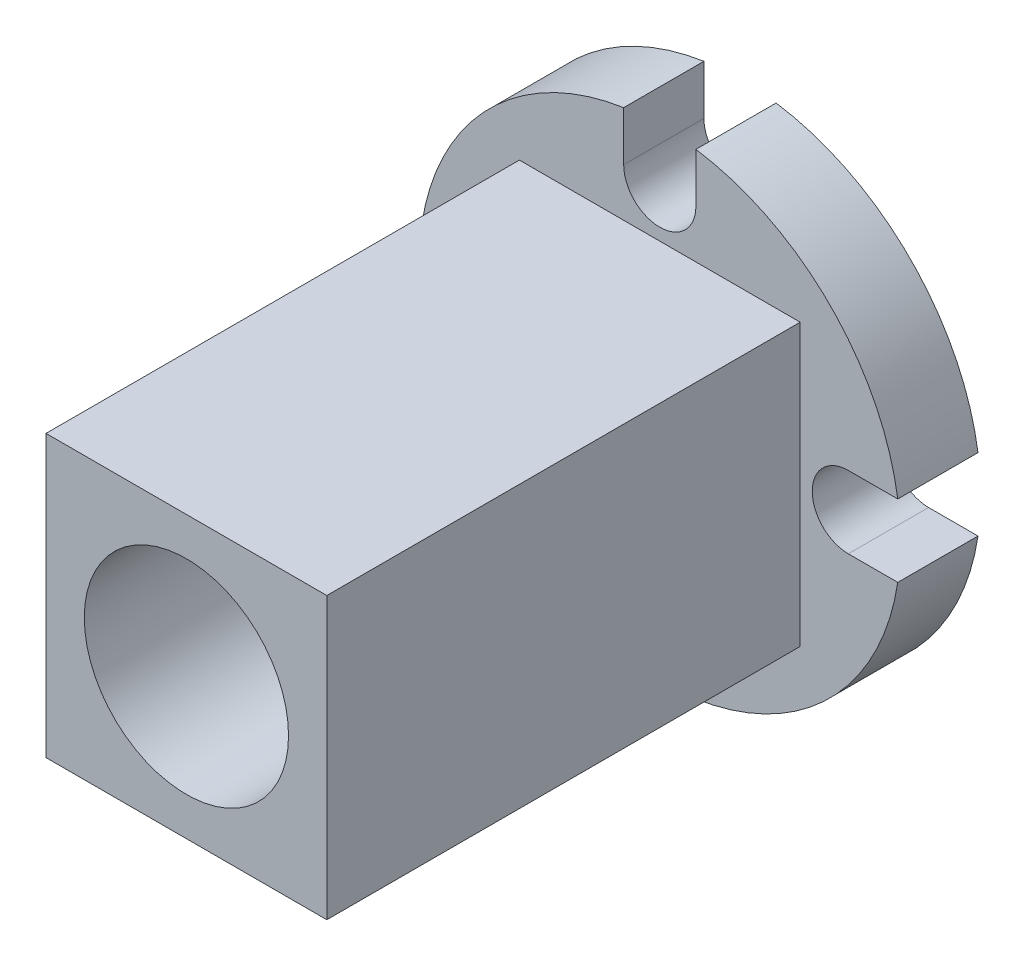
ISO-10303-21;
HEADER;
FILE_DESCRIPTION(('STEP AP214'),'2;1');
FILE_NAME('part.step','',(''),(''),'','','');
FILE_SCHEMA(('AUTOMOTIVE_DESIGN { 1 0 10303 214 1 1 1 1 }'));
ENDSEC;
DATA;
#1=APPLICATION_CONTEXT('core data for automotive mechanical design processes');
#2=APPLICATION_PROTOCOL_DEFINITION('international standard','automotive_design',2000,#1);
#3=PRODUCT_CONTEXT('',#1,'mechanical');
#4=PRODUCT('Part','Part','',(#3));
#5=PRODUCT_RELATED_PRODUCT_CATEGORY('part','',(#4));
#6=PRODUCT_DEFINITION_FORMATION('','',#4);
#7=PRODUCT_DEFINITION_CONTEXT('part definition',#1,'design');
#8=PRODUCT_DEFINITION('design','',#6,#7);
#9=PRODUCT_DEFINITION_SHAPE('','',#8);
#10=(LENGTH_UNIT() NAMED_UNIT(*) SI_UNIT(.MILLI.,.METRE.));
#11=(NAMED_UNIT(*) PLANE_ANGLE_UNIT() SI_UNIT($,.RADIAN.));
#12=(NAMED_UNIT(*) SI_UNIT($,.STERADIAN.) SOLID_ANGLE_UNIT());
#13=UNCERTAINTY_MEASURE_WITH_UNIT(LENGTH_MEASURE(1.E-05),#10,'distance_accuracy_value','');
#14=(GEOMETRIC_REPRESENTATION_CONTEXT(3) GLOBAL_UNCERTAINTY_ASSIGNED_CONTEXT((#13)) GLOBAL_UNIT_ASSIGNED_CONTEXT((#10,
#11,#12)) REPRESENTATION_CONTEXT('',''));
#15=CARTESIAN_POINT('',(0.,0.,0.));
#16=DIRECTION('',(0.,0.,1.));
#17=DIRECTION('',(1.,0.,0.));
#18=AXIS2_PLACEMENT_3D('',#15,#16,#17);
#19=CARTESIAN_POINT('',(-17.5,-17.5,69.));
#20=DIRECTION('',(0.,0.,1.));
#21=DIRECTION('',(1.,0.,0.));
#22=AXIS2_PLACEMENT_3D('',#19,#20,#21);
#23=PLANE('',#22);
#24=CARTESIAN_POINT('',(0.,0.,69.));
#25=DIRECTION('',(0.,0.,1.));
#26=DIRECTION('',(1.,0.,0.));
#27=AXIS2_PLACEMENT_3D('',#24,#25,#26);
#28=CIRCLE('',#27,12.7279220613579);
#29=CARTESIAN_POINT('',(12.7279220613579,0.,69.));
#30=VERTEX_POINT('',#29);
#31=EDGE_CURVE('E411',#30,#30,#28,.T.);
#32=ORIENTED_EDGE('',*,*,#31,.F.);
#33=EDGE_LOOP('',(#32));
#34=FACE_BOUND('',#33,.T.);
#35=DIRECTION('',(0.,-1.,0.));
#36=VECTOR('',#35,1.);
#37=CARTESIAN_POINT('',(-17.5,17.5,69.));
#38=LINE('',#37,#36);
#39=CARTESIAN_POINT('',(-17.5,17.5,69.));
#40=VERTEX_POINT('',#39);
#41=CARTESIAN_POINT('',(-17.5,-17.5,69.));
#42=VERTEX_POINT('',#41);
#43=EDGE_CURVE('E402',#40,#42,#38,.T.);
#44=ORIENTED_EDGE('',*,*,#43,.T.);
#45=DIRECTION('',(1.,0.,0.));
#46=VECTOR('',#45,1.);
#47=CARTESIAN_POINT('',(-17.5,-17.5,69.));
#48=LINE('',#47,#46);
#49=CARTESIAN_POINT('',(17.5,-17.5,69.));
#50=VERTEX_POINT('',#49);
#51=EDGE_CURVE('E417',#42,#50,#48,.T.);
#52=ORIENTED_EDGE('',*,*,#51,.T.);
#53=DIRECTION('',(0.,1.,0.));
#54=VECTOR('',#53,1.);
#55=CARTESIAN_POINT('',(17.5,17.5,69.));
#56=LINE('',#55,#54);
#57=CARTESIAN_POINT('',(17.5,17.5,69.));
#58=VERTEX_POINT('',#57);
#59=EDGE_CURVE('E414',#50,#58,#56,.T.);
#60=ORIENTED_EDGE('',*,*,#59,.T.);
#61=DIRECTION('',(-1.,0.,0.));
#62=VECTOR('',#61,1.);
#63=CARTESIAN_POINT('',(-17.5,17.5,69.));
#64=LINE('',#63,#62);
#65=EDGE_CURVE('E399',#58,#40,#64,.T.);
#66=ORIENTED_EDGE('',*,*,#65,.T.);
#67=EDGE_LOOP('',(#44,#52,#60,#66));
#68=FACE_BOUND('',#67,.T.);
#69=ADVANCED_FACE('F14',(#34,#68),#23,.T.);
#70=CARTESIAN_POINT('',(0.,0.,10.));
#71=DIRECTION('',(0.,0.,1.));
#72=DIRECTION('',(1.,0.,0.));
#73=AXIS2_PLACEMENT_3D('',#70,#71,#72);
#74=PLANE('',#73);
#75=CARTESIAN_POINT('',(0.,0.,10.));
#76=DIRECTION('',(0.,0.,1.));
#77=DIRECTION('',(1.,0.,0.));
#78=AXIS2_PLACEMENT_3D('',#75,#76,#77);
#79=CIRCLE('',#78,30.);
#80=CARTESIAN_POINT('',(-4.5,29.6605798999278,10.));
#81=VERTEX_POINT('',#80);
#82=CARTESIAN_POINT('',(-29.6605798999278,4.5,10.));
#83=VERTEX_POINT('',#82);
#84=EDGE_CURVE('E205',#81,#83,#79,.T.);
#85=ORIENTED_EDGE('',*,*,#84,.T.);
#86=DIRECTION('',(1.,0.,0.));
#87=VECTOR('',#86,1.);
#88=CARTESIAN_POINT('',(-29.6605798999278,4.5,10.));
#89=LINE('',#88,#87);
#90=CARTESIAN_POINT('',(-23.5,4.5,10.));
#91=VERTEX_POINT('',#90);
#92=EDGE_CURVE('E104',#83,#91,#89,.T.);
#93=ORIENTED_EDGE('',*,*,#92,.T.);
#94=CARTESIAN_POINT('',(-23.5,0.,10.));
#95=DIRECTION('',(0.,0.,-1.));
#96=DIRECTION('',(1.,0.,0.));
#97=AXIS2_PLACEMENT_3D('',#94,#95,#96);
#98=CIRCLE('',#97,4.5);
#99=CARTESIAN_POINT('',(-23.5,-4.5,10.));
#100=VERTEX_POINT('',#99);
#101=EDGE_CURVE('E360',#91,#100,#98,.T.);
#102=ORIENTED_EDGE('',*,*,#101,.T.);
#103=DIRECTION('',(-1.,0.,0.));
#104=VECTOR('',#103,1.);
#105=CARTESIAN_POINT('',(-29.6605798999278,-4.5,10.));
#106=LINE('',#105,#104);
#107=CARTESIAN_POINT('',(-29.6605798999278,-4.5,10.));
#108=VERTEX_POINT('',#107);
#109=EDGE_CURVE('E362',#100,#108,#106,.T.);
#110=ORIENTED_EDGE('',*,*,#109,.T.);
#111=CARTESIAN_POINT('',(0.,0.,10.));
#112=DIRECTION('',(0.,0.,1.));
#113=DIRECTION('',(1.,0.,0.));
#114=AXIS2_PLACEMENT_3D('',#111,#112,#113);
#115=CIRCLE('',#114,30.);
#116=CARTESIAN_POINT('',(-4.5,-29.6605798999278,10.));
#117=VERTEX_POINT('',#116);
#118=EDGE_CURVE('E364',#108,#117,#115,.T.);
#119=ORIENTED_EDGE('',*,*,#118,.T.);
#120=DIRECTION('',(0.,1.,0.));
#121=VECTOR('',#120,1.);
#122=CARTESIAN_POINT('',(-4.5,-29.6605798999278,10.));
#123=LINE('',#122,#121);
#124=CARTESIAN_POINT('',(-4.5,-23.5,10.));
#125=VERTEX_POINT('',#124);
#126=EDGE_CURVE('E370',#117,#125,#123,.T.);
#127=ORIENTED_EDGE('',*,*,#126,.T.);
#128=CARTESIAN_POINT('',(0.,-23.5,10.));
#129=DIRECTION('',(0.,0.,-1.));
#130=DIRECTION('',(1.,0.,0.));
#131=AXIS2_PLACEMENT_3D('',#128,#129,#130);
#132=CIRCLE('',#131,4.5);
#133=CARTESIAN_POINT('',(4.5,-23.5,10.));
#134=VERTEX_POINT('',#133);
#135=EDGE_CURVE('E372',#125,#134,#132,.T.);
#136=ORIENTED_EDGE('',*,*,#135,.T.);
#137=DIRECTION('',(0.,-1.,0.));
#138=VECTOR('',#137,1.);
#139=CARTESIAN_POINT('',(4.5,-29.6605798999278,10.));
#140=LINE('',#139,#138);
#141=CARTESIAN_POINT('',(4.5,-29.6605798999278,10.));
#142=VERTEX_POINT('',#141);
#143=EDGE_CURVE('E374',#134,#142,#140,.T.);
#144=ORIENTED_EDGE('',*,*,#143,.T.);
#145=CARTESIAN_POINT('',(0.,0.,10.));
#146=DIRECTION('',(0.,0.,1.));
#147=DIRECTION('',(1.,0.,0.));
#148=AXIS2_PLACEMENT_3D('',#145,#146,#147);
#149=CIRCLE('',#148,30.);
#150=CARTESIAN_POINT('',(29.6605798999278,-4.5,10.));
#151=VERTEX_POINT('',#150);
#152=EDGE_CURVE('E376',#142,#151,#149,.T.);
#153=ORIENTED_EDGE('',*,*,#152,.T.);
#154=DIRECTION('',(-1.,0.,0.));
#155=VECTOR('',#154,1.);
#156=CARTESIAN_POINT('',(29.6605798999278,-4.5,10.));
#157=LINE('',#156,#155);
#158=CARTESIAN_POINT('',(23.5,-4.5,10.));
#159=VERTEX_POINT('',#158);
#160=EDGE_CURVE('E378',#151,#159,#157,.T.);
#161=ORIENTED_EDGE('',*,*,#160,.T.);
#162=CARTESIAN_POINT('',(23.5,0.,10.));
#163=DIRECTION('',(0.,0.,-1.));
#164=DIRECTION('',(1.,0.,0.));
#165=AXIS2_PLACEMENT_3D('',#162,#163,#164);
#166=CIRCLE('',#165,4.5);
#167=CARTESIAN_POINT('',(23.5,4.5,10.));
#168=VERTEX_POINT('',#167);
#169=EDGE_CURVE('E380',#159,#168,#166,.T.);
#170=ORIENTED_EDGE('',*,*,#169,.T.);
#171=DIRECTION('',(1.,0.,0.));
#172=VECTOR('',#171,1.);
#173=CARTESIAN_POINT('',(29.6605798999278,4.5,10.));
#174=LINE('',#173,#172);
#175=CARTESIAN_POINT('',(29.6605798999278,4.5,10.));
#176=VERTEX_POINT('',#175);
#177=EDGE_CURVE('E382',#168,#176,#174,.T.);
#178=ORIENTED_EDGE('',*,*,#177,.T.);
#179=CARTESIAN_POINT('',(0.,0.,10.));
#180=DIRECTION('',(0.,0.,1.));
#181=DIRECTION('',(1.,0.,0.));
#182=AXIS2_PLACEMENT_3D('',#179,#180,#181);
#183=CIRCLE('',#182,30.);
#184=CARTESIAN_POINT('',(4.5,29.6605798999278,10.));
#185=VERTEX_POINT('',#184);
#186=EDGE_CURVE('E152',#176,#185,#183,.T.);
#187=ORIENTED_EDGE('',*,*,#186,.T.);
#188=DIRECTION('',(0.,-1.,0.));
#189=VECTOR('',#188,1.);
#190=CARTESIAN_POINT('',(4.5,29.6605798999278,10.));
#191=LINE('',#190,#189);
#192=CARTESIAN_POINT('',(4.5,23.5,10.));
#193=VERTEX_POINT('',#192);
#194=EDGE_CURVE('E144',#185,#193,#191,.T.);
#195=ORIENTED_EDGE('',*,*,#194,.T.);
#196=CARTESIAN_POINT('',(0.,23.5,10.));
#197=DIRECTION('',(0.,0.,-1.));
#198=DIRECTION('',(1.,0.,0.));
#199=AXIS2_PLACEMENT_3D('',#196,#197,#198);
#200=CIRCLE('',#199,4.5);
#201=CARTESIAN_POINT('',(-4.5,23.5,10.));
#202=VERTEX_POINT('',#201);
#203=EDGE_CURVE('E149',#193,#202,#200,.T.);
#204=ORIENTED_EDGE('',*,*,#203,.T.);
#205=DIRECTION('',(0.,1.,0.));
#206=VECTOR('',#205,1.);
#207=CARTESIAN_POINT('',(-4.5,29.6605798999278,10.));
#208=LINE('',#207,#206);
#209=EDGE_CURVE('E38',#202,#81,#208,.T.);
#210=ORIENTED_EDGE('',*,*,#209,.T.);
#211=EDGE_LOOP('',(#85,#93,#102,#110,#119,#127,#136,#144,#153,#161,#170,#178,#187,#195,#204,#210));
#212=FACE_BOUND('',#211,.T.);
#213=DIRECTION('',(1.,0.,0.));
#214=VECTOR('',#213,1.);
#215=CARTESIAN_POINT('',(-17.5,-17.5,10.));
#216=LINE('',#215,#214);
#217=CARTESIAN_POINT('',(-17.5,-17.5,10.));
#218=VERTEX_POINT('',#217);
#219=CARTESIAN_POINT('',(17.5,-17.5,10.));
#220=VERTEX_POINT('',#219);
#221=EDGE_CURVE('E405',#218,#220,#216,.T.);
#222=ORIENTED_EDGE('',*,*,#221,.F.);
#223=DIRECTION('',(0.,-1.,0.));
#224=VECTOR('',#223,1.);
#225=CARTESIAN_POINT('',(-17.5,17.5,10.));
#226=LINE('',#225,#224);
#227=CARTESIAN_POINT('',(-17.5,17.5,10.));
#228=VERTEX_POINT('',#227);
#229=EDGE_CURVE('E408',#228,#218,#226,.T.);
#230=ORIENTED_EDGE('',*,*,#229,.F.);
#231=DIRECTION('',(-1.,0.,0.));
#232=VECTOR('',#231,1.);
#233=CARTESIAN_POINT('',(-17.5,17.5,10.));
#234=LINE('',#233,#232);
#235=CARTESIAN_POINT('',(17.5,17.5,10.));
#236=VERTEX_POINT('',#235);
#237=EDGE_CURVE('E400',#236,#228,#234,.T.);
#238=ORIENTED_EDGE('',*,*,#237,.F.);
#239=DIRECTION('',(0.,1.,0.));
#240=VECTOR('',#239,1.);
#241=CARTESIAN_POINT('',(17.5,17.5,10.));
#242=LINE('',#241,#240);
#243=EDGE_CURVE('E403',#220,#236,#242,.T.);
#244=ORIENTED_EDGE('',*,*,#243,.F.);
#245=EDGE_LOOP('',(#222,#230,#238,#244));
#246=FACE_BOUND('',#245,.T.);
#247=ADVANCED_FACE('F146',(#212,#246),#74,.T.);
#248=CARTESIAN_POINT('',(0.,0.,10.));
#249=DIRECTION('',(0.,0.,-1.));
#250=DIRECTION('',(-1.,0.,0.));
#251=AXIS2_PLACEMENT_3D('',#248,#249,#250);
#252=CYLINDRICAL_SURFACE('',#251,30.);
#253=CARTESIAN_POINT('',(0.,0.,0.));
#254=DIRECTION('',(0.,0.,1.));
#255=DIRECTION('',(1.,0.,0.));
#256=AXIS2_PLACEMENT_3D('',#253,#254,#255);
#257=CIRCLE('',#256,30.);
#258=CARTESIAN_POINT('',(-4.5,29.6605798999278,0.));
#259=VERTEX_POINT('',#258);
#260=CARTESIAN_POINT('',(-29.6605798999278,4.5,0.));
#261=VERTEX_POINT('',#260);
#262=EDGE_CURVE('E173',#259,#261,#257,.T.);
#263=ORIENTED_EDGE('',*,*,#262,.T.);
#264=DIRECTION('',(0.,0.,-1.));
#265=VECTOR('',#264,1.);
#266=CARTESIAN_POINT('',(-29.6605798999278,4.5,10.));
#267=LINE('',#266,#265);
#268=EDGE_CURVE('E242',#83,#261,#267,.T.);
#269=ORIENTED_EDGE('',*,*,#268,.F.);
#270=ORIENTED_EDGE('',*,*,#84,.F.);
#271=DIRECTION('',(0.,0.,-1.));
#272=VECTOR('',#271,1.);
#273=CARTESIAN_POINT('',(-4.5,29.6605798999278,10.));
#274=LINE('',#273,#272);
#275=EDGE_CURVE('E169',#81,#259,#274,.T.);
#276=ORIENTED_EDGE('',*,*,#275,.T.);
#277=EDGE_LOOP('',(#263,#269,#270,#276));
#278=FACE_BOUND('',#277,.T.);
#279=ADVANCED_FACE('F267',(#278),#252,.T.);
#280=CARTESIAN_POINT('',(-29.6605798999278,4.5,10.));
#281=DIRECTION('',(0.,1.,0.));
#282=DIRECTION('',(0.,0.,1.));
#283=AXIS2_PLACEMENT_3D('',#280,#281,#282);
#284=PLANE('',#283);
#285=DIRECTION('',(1.,0.,0.));
#286=VECTOR('',#285,1.);
#287=CARTESIAN_POINT('',(-29.6605798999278,4.5,0.));
#288=LINE('',#287,#286);
#289=CARTESIAN_POINT('',(-23.5,4.5,0.));
#290=VERTEX_POINT('',#289);
#291=EDGE_CURVE('E176',#261,#290,#288,.T.);
#292=ORIENTED_EDGE('',*,*,#291,.T.);
#293=DIRECTION('',(0.,0.,-1.));
#294=VECTOR('',#293,1.);
#295=CARTESIAN_POINT('',(-23.5,4.5,10.));
#296=LINE('',#295,#294);
#297=EDGE_CURVE('E239',#91,#290,#296,.T.);
#298=ORIENTED_EDGE('',*,*,#297,.F.);
#299=ORIENTED_EDGE('',*,*,#92,.F.);
#300=ORIENTED_EDGE('',*,*,#268,.T.);
#301=EDGE_LOOP('',(#292,#298,#299,#300));
#302=FACE_BOUND('',#301,.T.);
#303=ADVANCED_FACE('F344',(#302),#284,.F.);
#304=CARTESIAN_POINT('',(-23.5,0.,10.));
#305=DIRECTION('',(0.,0.,-1.));
#306=DIRECTION('',(-1.,0.,0.));
#307=AXIS2_PLACEMENT_3D('',#304,#305,#306);
#308=CYLINDRICAL_SURFACE('',#307,4.5);
#309=CARTESIAN_POINT('',(-23.5,0.,0.));
#310=DIRECTION('',(0.,0.,-1.));
#311=DIRECTION('',(1.,0.,0.));
#312=AXIS2_PLACEMENT_3D('',#309,#310,#311);
#313=CIRCLE('',#312,4.5);
#314=CARTESIAN_POINT('',(-23.5,-4.5,0.));
#315=VERTEX_POINT('',#314);
#316=EDGE_CURVE('E179',#290,#315,#313,.T.);
#317=ORIENTED_EDGE('',*,*,#316,.T.);
#318=DIRECTION('',(0.,0.,-1.));
#319=VECTOR('',#318,1.);
#320=CARTESIAN_POINT('',(-23.5,-4.5,10.));
#321=LINE('',#320,#319);
#322=EDGE_CURVE('E236',#100,#315,#321,.T.);
#323=ORIENTED_EDGE('',*,*,#322,.F.);
#324=ORIENTED_EDGE('',*,*,#101,.F.);
#325=ORIENTED_EDGE('',*,*,#297,.T.);
#326=EDGE_LOOP('',(#317,#323,#324,#325));
#327=FACE_BOUND('',#326,.T.);
#328=ADVANCED_FACE('F340',(#327),#308,.F.);
#329=CARTESIAN_POINT('',(-29.6605798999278,-4.5,10.));
#330=DIRECTION('',(0.,-1.,0.));
#331=DIRECTION('',(0.,0.,-1.));
#332=AXIS2_PLACEMENT_3D('',#329,#330,#331);
#333=PLANE('',#332);
#334=DIRECTION('',(-1.,0.,0.));
#335=VECTOR('',#334,1.);
#336=CARTESIAN_POINT('',(-29.6605798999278,-4.5,0.));
#337=LINE('',#336,#335);
#338=CARTESIAN_POINT('',(-29.6605798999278,-4.5,0.));
#339=VERTEX_POINT('',#338);
#340=EDGE_CURVE('E181',#315,#339,#337,.T.);
#341=ORIENTED_EDGE('',*,*,#340,.T.);
#342=DIRECTION('',(0.,0.,-1.));
#343=VECTOR('',#342,1.);
#344=CARTESIAN_POINT('',(-29.6605798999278,-4.5,10.));
#345=LINE('',#344,#343);
#346=EDGE_CURVE('E233',#108,#339,#345,.T.);
#347=ORIENTED_EDGE('',*,*,#346,.F.);
#348=ORIENTED_EDGE('',*,*,#109,.F.);
#349=ORIENTED_EDGE('',*,*,#322,.T.);
#350=EDGE_LOOP('',(#341,#347,#348,#349));
#351=FACE_BOUND('',#350,.T.);
#352=ADVANCED_FACE('F336',(#351),#333,.F.);
#353=CARTESIAN_POINT('',(0.,0.,10.));
#354=DIRECTION('',(0.,0.,-1.));
#355=DIRECTION('',(-1.,0.,0.));
#356=AXIS2_PLACEMENT_3D('',#353,#354,#355);
#357=CYLINDRICAL_SURFACE('',#356,30.);
#358=CARTESIAN_POINT('',(0.,0.,0.));
#359=DIRECTION('',(0.,0.,1.));
#360=DIRECTION('',(1.,0.,0.));
#361=AXIS2_PLACEMENT_3D('',#358,#359,#360);
#362=CIRCLE('',#361,30.);
#363=CARTESIAN_POINT('',(-4.5,-29.6605798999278,0.));
#364=VERTEX_POINT('',#363);
#365=EDGE_CURVE('E183',#339,#364,#362,.T.);
#366=ORIENTED_EDGE('',*,*,#365,.T.);
#367=DIRECTION('',(0.,0.,-1.));
#368=VECTOR('',#367,1.);
#369=CARTESIAN_POINT('',(-4.5,-29.6605798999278,10.));
#370=LINE('',#369,#368);
#371=EDGE_CURVE('E230',#117,#364,#370,.T.);
#372=ORIENTED_EDGE('',*,*,#371,.F.);
#373=ORIENTED_EDGE('',*,*,#118,.F.);
#374=ORIENTED_EDGE('',*,*,#346,.T.);
#375=EDGE_LOOP('',(#366,#372,#373,#374));
#376=FACE_BOUND('',#375,.T.);
#377=ADVANCED_FACE('F332',(#376),#357,.T.);
#378=CARTESIAN_POINT('',(-4.5,-29.6605798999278,10.));
#379=DIRECTION('',(-1.,0.,0.));
#380=DIRECTION('',(0.,-1.,0.));
#381=AXIS2_PLACEMENT_3D('',#378,#379,#380);
#382=PLANE('',#381);
#383=DIRECTION('',(0.,1.,0.));
#384=VECTOR('',#383,1.);
#385=CARTESIAN_POINT('',(-4.5,-29.6605798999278,0.));
#386=LINE('',#385,#384);
#387=CARTESIAN_POINT('',(-4.5,-23.5,0.));
#388=VERTEX_POINT('',#387);
#389=EDGE_CURVE('E185',#364,#388,#386,.T.);
#390=ORIENTED_EDGE('',*,*,#389,.T.);
#391=DIRECTION('',(0.,0.,-1.));
#392=VECTOR('',#391,1.);
#393=CARTESIAN_POINT('',(-4.5,-23.5,10.));
#394=LINE('',#393,#392);
#395=EDGE_CURVE('E227',#125,#388,#394,.T.);
#396=ORIENTED_EDGE('',*,*,#395,.F.);
#397=ORIENTED_EDGE('',*,*,#126,.F.);
#398=ORIENTED_EDGE('',*,*,#371,.T.);
#399=EDGE_LOOP('',(#390,#396,#397,#398));
#400=FACE_BOUND('',#399,.T.);
#401=ADVANCED_FACE('F328',(#400),#382,.F.);
#402=CARTESIAN_POINT('',(0.,-23.5,10.));
#403=DIRECTION('',(0.,0.,-1.));
#404=DIRECTION('',(-1.,0.,0.));
#405=AXIS2_PLACEMENT_3D('',#402,#403,#404);
#406=CYLINDRICAL_SURFACE('',#405,4.5);
#407=CARTESIAN_POINT('',(0.,-23.5,0.));
#408=DIRECTION('',(0.,0.,-1.));
#409=DIRECTION('',(1.,0.,0.));
#410=AXIS2_PLACEMENT_3D('',#407,#408,#409);
#411=CIRCLE('',#410,4.5);
#412=CARTESIAN_POINT('',(4.5,-23.5,0.));
#413=VERTEX_POINT('',#412);
#414=EDGE_CURVE('E187',#388,#413,#411,.T.);
#415=ORIENTED_EDGE('',*,*,#414,.T.);
#416=DIRECTION('',(0.,0.,-1.));
#417=VECTOR('',#416,1.);
#418=CARTESIAN_POINT('',(4.5,-23.5,10.));
#419=LINE('',#418,#417);
#420=EDGE_CURVE('E224',#134,#413,#419,.T.);
#421=ORIENTED_EDGE('',*,*,#420,.F.);
#422=ORIENTED_EDGE('',*,*,#135,.F.);
#423=ORIENTED_EDGE('',*,*,#395,.T.);
#424=EDGE_LOOP('',(#415,#421,#422,#423));
#425=FACE_BOUND('',#424,.T.);
#426=ADVANCED_FACE('F324',(#425),#406,.F.);
#427=CARTESIAN_POINT('',(4.5,-29.6605798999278,10.));
#428=DIRECTION('',(1.,0.,0.));
#429=DIRECTION('',(0.,1.,0.));
#430=AXIS2_PLACEMENT_3D('',#427,#428,#429);
#431=PLANE('',#430);
#432=DIRECTION('',(0.,-1.,0.));
#433=VECTOR('',#432,1.);
#434=CARTESIAN_POINT('',(4.5,-29.6605798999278,0.));
#435=LINE('',#434,#433);
#436=CARTESIAN_POINT('',(4.5,-29.6605798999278,0.));
#437=VERTEX_POINT('',#436);
#438=EDGE_CURVE('E189',#413,#437,#435,.T.);
#439=ORIENTED_EDGE('',*,*,#438,.T.);
#440=DIRECTION('',(0.,0.,-1.));
#441=VECTOR('',#440,1.);
#442=CARTESIAN_POINT('',(4.5,-29.6605798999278,10.));
#443=LINE('',#442,#441);
#444=EDGE_CURVE('E221',#142,#437,#443,.T.);
#445=ORIENTED_EDGE('',*,*,#444,.F.);
#446=ORIENTED_EDGE('',*,*,#143,.F.);
#447=ORIENTED_EDGE('',*,*,#420,.T.);
#448=EDGE_LOOP('',(#439,#445,#446,#447));
#449=FACE_BOUND('',#448,.T.);
#450=ADVANCED_FACE('F320',(#449),#431,.F.);
#451=CARTESIAN_POINT('',(0.,0.,10.));
#452=DIRECTION('',(0.,0.,-1.));
#453=DIRECTION('',(-1.,0.,0.));
#454=AXIS2_PLACEMENT_3D('',#451,#452,#453);
#455=CYLINDRICAL_SURFACE('',#454,30.);
#456=CARTESIAN_POINT('',(0.,0.,0.));
#457=DIRECTION('',(0.,0.,1.));
#458=DIRECTION('',(1.,0.,0.));
#459=AXIS2_PLACEMENT_3D('',#456,#457,#458);
#460=CIRCLE('',#459,30.);
#461=CARTESIAN_POINT('',(29.6605798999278,-4.5,0.));
#462=VERTEX_POINT('',#461);
#463=EDGE_CURVE('E191',#437,#462,#460,.T.);
#464=ORIENTED_EDGE('',*,*,#463,.T.);
#465=DIRECTION('',(0.,0.,-1.));
#466=VECTOR('',#465,1.);
#467=CARTESIAN_POINT('',(29.6605798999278,-4.5,10.));
#468=LINE('',#467,#466);
#469=EDGE_CURVE('E218',#151,#462,#468,.T.);
#470=ORIENTED_EDGE('',*,*,#469,.F.);
#471=ORIENTED_EDGE('',*,*,#152,.F.);
#472=ORIENTED_EDGE('',*,*,#444,.T.);
#473=EDGE_LOOP('',(#464,#470,#471,#472));
#474=FACE_BOUND('',#473,.T.);
#475=ADVANCED_FACE('F316',(#474),#455,.T.);
#476=CARTESIAN_POINT('',(29.6605798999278,-4.5,10.));
#477=DIRECTION('',(0.,-1.,0.));
#478=DIRECTION('',(1.,0.,0.));
#479=AXIS2_PLACEMENT_3D('',#476,#477,#478);
#480=PLANE('',#479);
#481=DIRECTION('',(-1.,0.,0.));
#482=VECTOR('',#481,1.);
#483=CARTESIAN_POINT('',(29.6605798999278,-4.5,0.));
#484=LINE('',#483,#482);
#485=CARTESIAN_POINT('',(23.5,-4.5,0.));
#486=VERTEX_POINT('',#485);
#487=EDGE_CURVE('E193',#462,#486,#484,.T.);
#488=ORIENTED_EDGE('',*,*,#487,.T.);
#489=DIRECTION('',(0.,0.,-1.));
#490=VECTOR('',#489,1.);
#491=CARTESIAN_POINT('',(23.5,-4.5,10.));
#492=LINE('',#491,#490);
#493=EDGE_CURVE('E215',#159,#486,#492,.T.);
#494=ORIENTED_EDGE('',*,*,#493,.F.);
#495=ORIENTED_EDGE('',*,*,#160,.F.);
#496=ORIENTED_EDGE('',*,*,#469,.T.);
#497=EDGE_LOOP('',(#488,#494,#495,#496));
#498=FACE_BOUND('',#497,.T.);
#499=ADVANCED_FACE('F312',(#498),#480,.F.);
#500=CARTESIAN_POINT('',(23.5,0.,10.));
#501=DIRECTION('',(0.,0.,-1.));
#502=DIRECTION('',(-1.,0.,0.));
#503=AXIS2_PLACEMENT_3D('',#500,#501,#502);
#504=CYLINDRICAL_SURFACE('',#503,4.5);
#505=CARTESIAN_POINT('',(23.5,0.,0.));
#506=DIRECTION('',(0.,0.,-1.));
#507=DIRECTION('',(1.,0.,0.));
#508=AXIS2_PLACEMENT_3D('',#505,#506,#507);
#509=CIRCLE('',#508,4.5);
#510=CARTESIAN_POINT('',(23.5,4.5,0.));
#511=VERTEX_POINT('',#510);
#512=EDGE_CURVE('E195',#486,#511,#509,.T.);
#513=ORIENTED_EDGE('',*,*,#512,.T.);
#514=DIRECTION('',(0.,0.,-1.));
#515=VECTOR('',#514,1.);
#516=CARTESIAN_POINT('',(23.5,4.5,10.));
#517=LINE('',#516,#515);
#518=EDGE_CURVE('E212',#168,#511,#517,.T.);
#519=ORIENTED_EDGE('',*,*,#518,.F.);
#520=ORIENTED_EDGE('',*,*,#169,.F.);
#521=ORIENTED_EDGE('',*,*,#493,.T.);
#522=EDGE_LOOP('',(#513,#519,#520,#521));
#523=FACE_BOUND('',#522,.T.);
#524=ADVANCED_FACE('F308',(#523),#504,.F.);
#525=CARTESIAN_POINT('',(29.6605798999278,4.5,10.));
#526=DIRECTION('',(0.,1.,0.));
#527=DIRECTION('',(-1.,0.,0.));
#528=AXIS2_PLACEMENT_3D('',#525,#526,#527);
#529=PLANE('',#528);
#530=DIRECTION('',(1.,0.,0.));
#531=VECTOR('',#530,1.);
#532=CARTESIAN_POINT('',(29.6605798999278,4.5,0.));
#533=LINE('',#532,#531);
#534=CARTESIAN_POINT('',(29.6605798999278,4.5,0.));
#535=VERTEX_POINT('',#534);
#536=EDGE_CURVE('E197',#511,#535,#533,.T.);
#537=ORIENTED_EDGE('',*,*,#536,.T.);
#538=DIRECTION('',(0.,0.,-1.));
#539=VECTOR('',#538,1.);
#540=CARTESIAN_POINT('',(29.6605798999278,4.5,10.));
#541=LINE('',#540,#539);
#542=EDGE_CURVE('E209',#176,#535,#541,.T.);
#543=ORIENTED_EDGE('',*,*,#542,.F.);
#544=ORIENTED_EDGE('',*,*,#177,.F.);
#545=ORIENTED_EDGE('',*,*,#518,.T.);
#546=EDGE_LOOP('',(#537,#543,#544,#545));
#547=FACE_BOUND('',#546,.T.);
#548=ADVANCED_FACE('F304',(#547),#529,.F.);
#549=CARTESIAN_POINT('',(0.,0.,10.));
#550=DIRECTION('',(0.,0.,-1.));
#551=DIRECTION('',(-1.,0.,0.));
#552=AXIS2_PLACEMENT_3D('',#549,#550,#551);
#553=CYLINDRICAL_SURFACE('',#552,30.);
#554=CARTESIAN_POINT('',(0.,0.,0.));
#555=DIRECTION('',(0.,0.,1.));
#556=DIRECTION('',(1.,0.,0.));
#557=AXIS2_PLACEMENT_3D('',#554,#555,#556);
#558=CIRCLE('',#557,30.);
#559=CARTESIAN_POINT('',(4.5,29.6605798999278,0.));
#560=VERTEX_POINT('',#559);
#561=EDGE_CURVE('E199',#535,#560,#558,.T.);
#562=ORIENTED_EDGE('',*,*,#561,.T.);
#563=DIRECTION('',(0.,0.,-1.));
#564=VECTOR('',#563,1.);
#565=CARTESIAN_POINT('',(4.5,29.6605798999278,10.));
#566=LINE('',#565,#564);
#567=EDGE_CURVE('E164',#185,#560,#566,.T.);
#568=ORIENTED_EDGE('',*,*,#567,.F.);
#569=ORIENTED_EDGE('',*,*,#186,.F.);
#570=ORIENTED_EDGE('',*,*,#542,.T.);
#571=EDGE_LOOP('',(#562,#568,#569,#570));
#572=FACE_BOUND('',#571,.T.);
#573=ADVANCED_FACE('F301',(#572),#553,.T.);
#574=CARTESIAN_POINT('',(4.5,29.6605798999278,10.));
#575=DIRECTION('',(1.,0.,0.));
#576=DIRECTION('',(0.,1.,0.));
#577=AXIS2_PLACEMENT_3D('',#574,#575,#576);
#578=PLANE('',#577);
#579=DIRECTION('',(0.,-1.,0.));
#580=VECTOR('',#579,1.);
#581=CARTESIAN_POINT('',(4.5,29.6605798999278,0.));
#582=LINE('',#581,#580);
#583=CARTESIAN_POINT('',(4.5,23.5,0.));
#584=VERTEX_POINT('',#583);
#585=EDGE_CURVE('E161',#560,#584,#582,.T.);
#586=ORIENTED_EDGE('',*,*,#585,.T.);
#587=DIRECTION('',(0.,0.,-1.));
#588=VECTOR('',#587,1.);
#589=CARTESIAN_POINT('',(4.5,23.5,10.));
#590=LINE('',#589,#588);
#591=EDGE_CURVE('E158',#193,#584,#590,.T.);
#592=ORIENTED_EDGE('',*,*,#591,.F.);
#593=ORIENTED_EDGE('',*,*,#194,.F.);
#594=ORIENTED_EDGE('',*,*,#567,.T.);
#595=EDGE_LOOP('',(#586,#592,#593,#594));
#596=FACE_BOUND('',#595,.T.);
#597=ADVANCED_FACE('F159',(#596),#578,.F.);
#598=CARTESIAN_POINT('',(0.,23.5,10.));
#599=DIRECTION('',(0.,0.,-1.));
#600=DIRECTION('',(-1.,0.,0.));
#601=AXIS2_PLACEMENT_3D('',#598,#599,#600);
#602=CYLINDRICAL_SURFACE('',#601,4.5);
#603=CARTESIAN_POINT('',(0.,23.5,0.));
#604=DIRECTION('',(0.,0.,-1.));
#605=DIRECTION('',(1.,0.,0.));
#606=AXIS2_PLACEMENT_3D('',#603,#604,#605);
#607=CIRCLE('',#606,4.5);
#608=CARTESIAN_POINT('',(-4.5,23.5,0.));
#609=VERTEX_POINT('',#608);
#610=EDGE_CURVE('E202',#584,#609,#607,.T.);
#611=ORIENTED_EDGE('',*,*,#610,.T.);
#612=DIRECTION('',(0.,0.,-1.));
#613=VECTOR('',#612,1.);
#614=CARTESIAN_POINT('',(-4.5,23.5,10.));
#615=LINE('',#614,#613);
#616=EDGE_CURVE('E165',#202,#609,#615,.T.);
#617=ORIENTED_EDGE('',*,*,#616,.F.);
#618=ORIENTED_EDGE('',*,*,#203,.F.);
#619=ORIENTED_EDGE('',*,*,#591,.T.);
#620=EDGE_LOOP('',(#611,#617,#618,#619));
#621=FACE_BOUND('',#620,.T.);
#622=ADVANCED_FACE('F167',(#621),#602,.F.);
#623=CARTESIAN_POINT('',(-4.5,29.6605798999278,10.));
#624=DIRECTION('',(-1.,0.,0.));
#625=DIRECTION('',(0.,-1.,0.));
#626=AXIS2_PLACEMENT_3D('',#623,#624,#625);
#627=PLANE('',#626);
#628=DIRECTION('',(0.,1.,0.));
#629=VECTOR('',#628,1.);
#630=CARTESIAN_POINT('',(-4.5,29.6605798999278,0.));
#631=LINE('',#630,#629);
#632=EDGE_CURVE('E95',#609,#259,#631,.T.);
#633=ORIENTED_EDGE('',*,*,#632,.T.);
#634=ORIENTED_EDGE('',*,*,#275,.F.);
#635=ORIENTED_EDGE('',*,*,#209,.F.);
#636=ORIENTED_EDGE('',*,*,#616,.T.);
#637=EDGE_LOOP('',(#633,#634,#635,#636));
#638=FACE_BOUND('',#637,.T.);
#639=ADVANCED_FACE('F293',(#638),#627,.F.);
#640=CARTESIAN_POINT('',(0.,0.,0.));
#641=DIRECTION('',(0.,0.,1.));
#642=DIRECTION('',(1.,0.,0.));
#643=AXIS2_PLACEMENT_3D('',#640,#641,#642);
#644=PLANE('',#643);
#645=CARTESIAN_POINT('',(0.,0.,0.));
#646=DIRECTION('',(0.,0.,1.));
#647=DIRECTION('',(1.,0.,0.));
#648=AXIS2_PLACEMENT_3D('',#645,#646,#647);
#649=CIRCLE('',#648,5.65);
#650=CARTESIAN_POINT('',(5.65,0.,0.));
#651=VERTEX_POINT('',#650);
#652=EDGE_CURVE('E9',#651,#651,#649,.T.);
#653=ORIENTED_EDGE('',*,*,#652,.T.);
#654=EDGE_LOOP('',(#653));
#655=FACE_BOUND('',#654,.T.);
#656=ORIENTED_EDGE('',*,*,#262,.F.);
#657=ORIENTED_EDGE('',*,*,#632,.F.);
#658=ORIENTED_EDGE('',*,*,#610,.F.);
#659=ORIENTED_EDGE('',*,*,#585,.F.);
#660=ORIENTED_EDGE('',*,*,#561,.F.);
#661=ORIENTED_EDGE('',*,*,#536,.F.);
#662=ORIENTED_EDGE('',*,*,#512,.F.);
#663=ORIENTED_EDGE('',*,*,#487,.F.);
#664=ORIENTED_EDGE('',*,*,#463,.F.);
#665=ORIENTED_EDGE('',*,*,#438,.F.);
#666=ORIENTED_EDGE('',*,*,#414,.F.);
#667=ORIENTED_EDGE('',*,*,#389,.F.);
#668=ORIENTED_EDGE('',*,*,#365,.F.);
#669=ORIENTED_EDGE('',*,*,#340,.F.);
#670=ORIENTED_EDGE('',*,*,#316,.F.);
#671=ORIENTED_EDGE('',*,*,#291,.F.);
#672=EDGE_LOOP('',(#656,#657,#658,#659,#660,#661,#662,#663,#664,#665,#666,#667,#668,#669,#670,#671));
#673=FACE_BOUND('',#672,.T.);
#674=ADVANCED_FACE('F288',(#655,#673),#644,.F.);
#675=CARTESIAN_POINT('',(-17.5,17.5,69.));
#676=DIRECTION('',(1.,0.,0.));
#677=DIRECTION('',(0.,1.,0.));
#678=AXIS2_PLACEMENT_3D('',#675,#676,#677);
#679=PLANE('',#678);
#680=ORIENTED_EDGE('',*,*,#229,.T.);
#681=DIRECTION('',(0.,0.,-1.));
#682=VECTOR('',#681,1.);
#683=CARTESIAN_POINT('',(-17.5,-17.5,69.));
#684=LINE('',#683,#682);
#685=EDGE_CURVE('E177',#42,#218,#684,.T.);
#686=ORIENTED_EDGE('',*,*,#685,.F.);
#687=ORIENTED_EDGE('',*,*,#43,.F.);
#688=DIRECTION('',(0.,0.,-1.));
#689=VECTOR('',#688,1.);
#690=CARTESIAN_POINT('',(-17.5,17.5,69.));
#691=LINE('',#690,#689);
#692=EDGE_CURVE('E396',#40,#228,#691,.T.);
#693=ORIENTED_EDGE('',*,*,#692,.T.);
#694=EDGE_LOOP('',(#680,#686,#687,#693));
#695=FACE_BOUND('',#694,.T.);
#696=ADVANCED_FACE('F285',(#695),#679,.F.);
#697=CARTESIAN_POINT('',(-17.5,-17.5,69.));
#698=DIRECTION('',(0.,1.,0.));
#699=DIRECTION('',(0.,0.,1.));
#700=AXIS2_PLACEMENT_3D('',#697,#698,#699);
#701=PLANE('',#700);
#702=ORIENTED_EDGE('',*,*,#221,.T.);
#703=DIRECTION('',(0.,0.,-1.));
#704=VECTOR('',#703,1.);
#705=CARTESIAN_POINT('',(17.5,-17.5,69.));
#706=LINE('',#705,#704);
#707=EDGE_CURVE('E392',#50,#220,#706,.T.);
#708=ORIENTED_EDGE('',*,*,#707,.F.);
#709=ORIENTED_EDGE('',*,*,#51,.F.);
#710=ORIENTED_EDGE('',*,*,#685,.T.);
#711=EDGE_LOOP('',(#702,#708,#709,#710));
#712=FACE_BOUND('',#711,.T.);
#713=ADVANCED_FACE('F281',(#712),#701,.F.);
#714=CARTESIAN_POINT('',(17.5,17.5,69.));
#715=DIRECTION('',(-1.,0.,0.));
#716=DIRECTION('',(0.,-1.,0.));
#717=AXIS2_PLACEMENT_3D('',#714,#715,#716);
#718=PLANE('',#717);
#719=ORIENTED_EDGE('',*,*,#243,.T.);
#720=DIRECTION('',(0.,0.,-1.));
#721=VECTOR('',#720,1.);
#722=CARTESIAN_POINT('',(17.5,17.5,69.));
#723=LINE('',#722,#721);
#724=EDGE_CURVE('E29',#58,#236,#723,.T.);
#725=ORIENTED_EDGE('',*,*,#724,.F.);
#726=ORIENTED_EDGE('',*,*,#59,.F.);
#727=ORIENTED_EDGE('',*,*,#707,.T.);
#728=EDGE_LOOP('',(#719,#725,#726,#727));
#729=FACE_BOUND('',#728,.T.);
#730=ADVANCED_FACE('F278',(#729),#718,.F.);
#731=CARTESIAN_POINT('',(-17.5,17.5,69.));
#732=DIRECTION('',(0.,-1.,0.));
#733=DIRECTION('',(0.,0.,-1.));
#734=AXIS2_PLACEMENT_3D('',#731,#732,#733);
#735=PLANE('',#734);
#736=ORIENTED_EDGE('',*,*,#237,.T.);
#737=ORIENTED_EDGE('',*,*,#692,.F.);
#738=ORIENTED_EDGE('',*,*,#65,.F.);
#739=ORIENTED_EDGE('',*,*,#724,.T.);
#740=EDGE_LOOP('',(#736,#737,#738,#739));
#741=FACE_BOUND('',#740,.T.);
#742=ADVANCED_FACE('F275',(#741),#735,.F.);
#743=CARTESIAN_POINT('',(0.,0.,49.));
#744=DIRECTION('',(0.,0.,1.));
#745=DIRECTION('',(1.,0.,0.));
#746=AXIS2_PLACEMENT_3D('',#743,#744,#745);
#747=CYLINDRICAL_SURFACE('',#746,12.7279220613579);
#748=ORIENTED_EDGE('',*,*,#31,.T.);
#749=EDGE_LOOP('',(#748));
#750=FACE_BOUND('',#749,.T.);
#751=CARTESIAN_POINT('',(0.,0.,49.));
#752=DIRECTION('',(0.,0.,1.));
#753=DIRECTION('',(1.,0.,0.));
#754=AXIS2_PLACEMENT_3D('',#751,#752,#753);
#755=CIRCLE('',#754,12.7279220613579);
#756=CARTESIAN_POINT('',(12.7279220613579,0.,49.));
#757=VERTEX_POINT('',#756);
#758=EDGE_CURVE('E424',#757,#757,#755,.T.);
#759=ORIENTED_EDGE('',*,*,#758,.F.);
#760=EDGE_LOOP('',(#759));
#761=FACE_BOUND('',#760,.T.);
#762=ADVANCED_FACE('F273',(#750,#761),#747,.F.);
#763=CARTESIAN_POINT('',(0.,0.,49.));
#764=DIRECTION('',(0.,0.,1.));
#765=DIRECTION('',(1.,0.,0.));
#766=AXIS2_PLACEMENT_3D('',#763,#764,#765);
#767=PLANE('',#766);
#768=ORIENTED_EDGE('',*,*,#758,.T.);
#769=EDGE_LOOP('',(#768));
#770=FACE_BOUND('',#769,.T.);
#771=ADVANCED_FACE('F431',(#770),#767,.T.);
#772=CARTESIAN_POINT('',(0.,0.,30.));
#773=DIRECTION('',(0.,0.,-1.));
#774=DIRECTION('',(-1.,0.,0.));
#775=AXIS2_PLACEMENT_3D('',#772,#773,#774);
#776=CYLINDRICAL_SURFACE('',#775,5.);
#777=CARTESIAN_POINT('',(0.,0.,0.649999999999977));
#778=DIRECTION('',(0.,0.,1.));
#779=DIRECTION('',(1.,0.,0.));
#780=AXIS2_PLACEMENT_3D('',#777,#778,#779);
#781=CIRCLE('',#780,5.);
#782=CARTESIAN_POINT('',(5.,0.,0.649999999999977));
#783=VERTEX_POINT('',#782);
#784=EDGE_CURVE('E22',#783,#783,#781,.F.);
#785=ORIENTED_EDGE('',*,*,#784,.T.);
#786=EDGE_LOOP('',(#785));
#787=FACE_BOUND('',#786,.T.);
#788=CARTESIAN_POINT('',(0.,0.,30.));
#789=DIRECTION('',(0.,0.,-1.));
#790=DIRECTION('',(-1.,0.,0.));
#791=AXIS2_PLACEMENT_3D('',#788,#789,#790);
#792=CIRCLE('',#791,5.);
#793=CARTESIAN_POINT('',(-5.,0.,30.));
#794=VERTEX_POINT('',#793);
#795=EDGE_CURVE('E427',#794,#794,#792,.T.);
#796=ORIENTED_EDGE('',*,*,#795,.F.);
#797=EDGE_LOOP('',(#796));
#798=FACE_BOUND('',#797,.T.);
#799=ADVANCED_FACE('F246',(#787,#798),#776,.F.);
#800=CARTESIAN_POINT('',(0.,0.,30.));
#801=DIRECTION('',(0.,0.,-1.));
#802=DIRECTION('',(-1.,0.,0.));
#803=AXIS2_PLACEMENT_3D('',#800,#801,#802);
#804=PLANE('',#803);
#805=ORIENTED_EDGE('',*,*,#795,.T.);
#806=EDGE_LOOP('',(#805));
#807=FACE_BOUND('',#806,.T.);
#808=ADVANCED_FACE('F250',(#807),#804,.T.);
#809=CARTESIAN_POINT('',(0.,0.,0.649999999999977));
#810=DIRECTION('',(0.,0.,-1.));
#811=DIRECTION('',(-1.,0.,0.));
#812=AXIS2_PLACEMENT_3D('',#809,#810,#811);
#813=CONICAL_SURFACE('',#812,5.,0.785398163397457);
#814=ORIENTED_EDGE('',*,*,#652,.F.);
#815=EDGE_LOOP('',(#814));
#816=FACE_BOUND('',#815,.T.);
#817=ORIENTED_EDGE('',*,*,#784,.F.);
#818=EDGE_LOOP('',(#817));
#819=FACE_BOUND('',#818,.T.);
#820=ADVANCED_FACE('F16',(#816,#819),#813,.F.);
#821=CLOSED_SHELL('',(#69,#247,#279,#303,#328,#352,#377,#401,#426,#450,#475,#499,#524,#548,#573,
#597,#622,#639,#674,#696,#713,#730,#742,#762,#771,#799,#808,#820));
#822=MANIFOLD_SOLID_BREP('B1',#821);
#823=ADVANCED_BREP_SHAPE_REPRESENTATION('',(#18,#822),#14);
#824=SHAPE_DEFINITION_REPRESENTATION(#9,#823);
ENDSEC;
END-ISO-10303-21;
